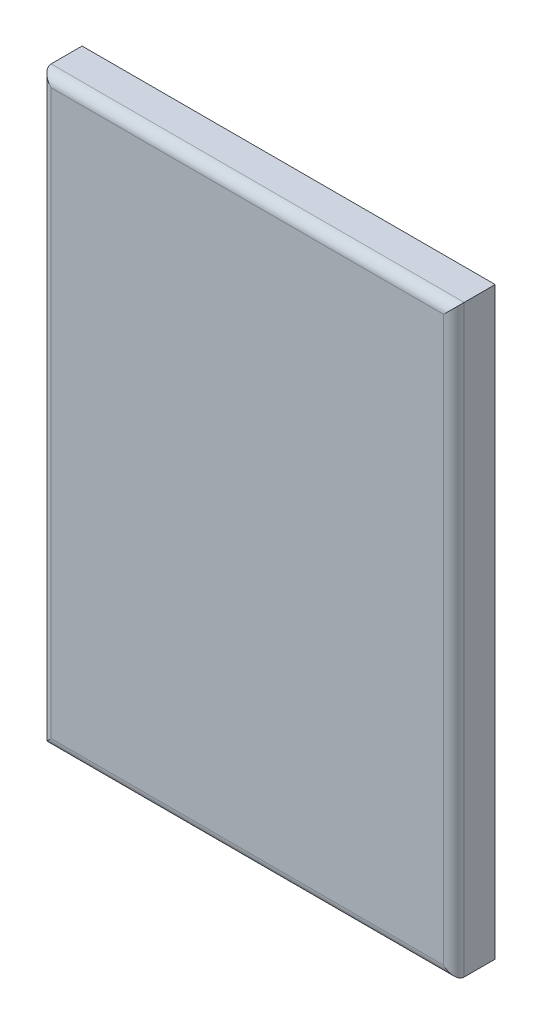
ISO-10303-21;
HEADER;
FILE_DESCRIPTION(('STEP AP214'),'2;1');
FILE_NAME('part.step','',(''),(''),'','','');
FILE_SCHEMA(('AUTOMOTIVE_DESIGN { 1 0 10303 214 1 1 1 1 }'));
ENDSEC;
DATA;
#1=APPLICATION_CONTEXT('core data for automotive mechanical design processes');
#2=APPLICATION_PROTOCOL_DEFINITION('international standard','automotive_design',2000,#1);
#3=PRODUCT_CONTEXT('',#1,'mechanical');
#4=PRODUCT('Part','Part','',(#3));
#5=PRODUCT_RELATED_PRODUCT_CATEGORY('part','',(#4));
#6=PRODUCT_DEFINITION_FORMATION('','',#4);
#7=PRODUCT_DEFINITION_CONTEXT('part definition',#1,'design');
#8=PRODUCT_DEFINITION('design','',#6,#7);
#9=PRODUCT_DEFINITION_SHAPE('','',#8);
#10=(LENGTH_UNIT() NAMED_UNIT(*) SI_UNIT(.MILLI.,.METRE.));
#11=(NAMED_UNIT(*) PLANE_ANGLE_UNIT() SI_UNIT($,.RADIAN.));
#12=(NAMED_UNIT(*) SI_UNIT($,.STERADIAN.) SOLID_ANGLE_UNIT());
#13=UNCERTAINTY_MEASURE_WITH_UNIT(LENGTH_MEASURE(1.E-05),#10,'distance_accuracy_value','');
#14=(GEOMETRIC_REPRESENTATION_CONTEXT(3) GLOBAL_UNCERTAINTY_ASSIGNED_CONTEXT((#13)) GLOBAL_UNIT_ASSIGNED_CONTEXT((#10,
#11,#12)) REPRESENTATION_CONTEXT('',''));
#15=CARTESIAN_POINT('',(0.,0.,0.));
#16=DIRECTION('',(0.,0.,1.));
#17=DIRECTION('',(1.,0.,0.));
#18=AXIS2_PLACEMENT_3D('',#15,#16,#17);
#19=CARTESIAN_POINT('',(40.,0.,4.));
#20=DIRECTION('',(-1.,0.,0.));
#21=DIRECTION('',(0.,0.,1.));
#22=AXIS2_PLACEMENT_3D('',#19,#20,#21);
#23=PLANE('',#22);
#24=DIRECTION('',(0.,0.,-1.));
#25=VECTOR('',#24,1.);
#26=CARTESIAN_POINT('',(40.,56.57,4.));
#27=LINE('',#26,#25);
#28=CARTESIAN_POINT('',(40.,56.57,3.));
#29=VERTEX_POINT('',#28);
#30=CARTESIAN_POINT('',(40.,56.57,0.));
#31=VERTEX_POINT('',#30);
#32=EDGE_CURVE('E82',#29,#31,#27,.T.);
#33=ORIENTED_EDGE('',*,*,#32,.F.);
#34=DIRECTION('',(0.,1.,0.));
#35=VECTOR('',#34,1.);
#36=CARTESIAN_POINT('',(40.,0.,3.));
#37=LINE('',#36,#35);
#38=CARTESIAN_POINT('',(40.,0.,3.));
#39=VERTEX_POINT('',#38);
#40=EDGE_CURVE('E11',#29,#39,#37,.F.);
#41=ORIENTED_EDGE('',*,*,#40,.T.);
#42=DIRECTION('',(0.,0.,-1.));
#43=VECTOR('',#42,1.);
#44=CARTESIAN_POINT('',(40.,0.,4.));
#45=LINE('',#44,#43);
#46=CARTESIAN_POINT('',(40.,0.,0.));
#47=VERTEX_POINT('',#46);
#48=EDGE_CURVE('E102',#39,#47,#45,.T.);
#49=ORIENTED_EDGE('',*,*,#48,.T.);
#50=DIRECTION('',(0.,1.,0.));
#51=VECTOR('',#50,1.);
#52=CARTESIAN_POINT('',(40.,0.,0.));
#53=LINE('',#52,#51);
#54=EDGE_CURVE('E97',#47,#31,#53,.T.);
#55=ORIENTED_EDGE('',*,*,#54,.T.);
#56=EDGE_LOOP('',(#33,#41,#49,#55));
#57=FACE_BOUND('',#56,.T.);
#58=ADVANCED_FACE('F30',(#57),#23,.F.);
#59=CARTESIAN_POINT('',(40.,56.57,4.));
#60=DIRECTION('',(0.,-1.,0.));
#61=DIRECTION('',(0.,0.,-1.));
#62=AXIS2_PLACEMENT_3D('',#59,#60,#61);
#63=PLANE('',#62);
#64=DIRECTION('',(0.,0.,-1.));
#65=VECTOR('',#64,1.);
#66=CARTESIAN_POINT('',(0.,56.57,4.));
#67=LINE('',#66,#65);
#68=CARTESIAN_POINT('',(0.,56.57,3.));
#69=VERTEX_POINT('',#68);
#70=CARTESIAN_POINT('',(0.,56.57,0.));
#71=VERTEX_POINT('',#70);
#72=EDGE_CURVE('E91',#69,#71,#67,.T.);
#73=ORIENTED_EDGE('',*,*,#72,.F.);
#74=DIRECTION('',(-1.,0.,0.));
#75=VECTOR('',#74,1.);
#76=CARTESIAN_POINT('',(40.,56.57,3.));
#77=LINE('',#76,#75);
#78=EDGE_CURVE('E39',#69,#29,#77,.F.);
#79=ORIENTED_EDGE('',*,*,#78,.T.);
#80=ORIENTED_EDGE('',*,*,#32,.T.);
#81=DIRECTION('',(-1.,0.,0.));
#82=VECTOR('',#81,1.);
#83=CARTESIAN_POINT('',(40.,56.57,0.));
#84=LINE('',#83,#82);
#85=EDGE_CURVE('E85',#31,#71,#84,.T.);
#86=ORIENTED_EDGE('',*,*,#85,.T.);
#87=EDGE_LOOP('',(#73,#79,#80,#86));
#88=FACE_BOUND('',#87,.T.);
#89=ADVANCED_FACE('F84',(#88),#63,.F.);
#90=CARTESIAN_POINT('',(0.,0.,4.));
#91=DIRECTION('',(1.,0.,0.));
#92=DIRECTION('',(0.,1.,0.));
#93=AXIS2_PLACEMENT_3D('',#90,#91,#92);
#94=PLANE('',#93);
#95=DIRECTION('',(0.,0.,-1.));
#96=VECTOR('',#95,1.);
#97=CARTESIAN_POINT('',(0.,0.,4.));
#98=LINE('',#97,#96);
#99=CARTESIAN_POINT('',(0.,0.,3.));
#100=VERTEX_POINT('',#99);
#101=CARTESIAN_POINT('',(0.,0.,0.));
#102=VERTEX_POINT('',#101);
#103=EDGE_CURVE('E112',#100,#102,#98,.T.);
#104=ORIENTED_EDGE('',*,*,#103,.F.);
#105=DIRECTION('',(0.,-1.,0.));
#106=VECTOR('',#105,1.);
#107=CARTESIAN_POINT('',(0.,56.57,3.));
#108=LINE('',#107,#106);
#109=EDGE_CURVE('E54',#100,#69,#108,.F.);
#110=ORIENTED_EDGE('',*,*,#109,.T.);
#111=ORIENTED_EDGE('',*,*,#72,.T.);
#112=DIRECTION('',(0.,-1.,0.));
#113=VECTOR('',#112,1.);
#114=CARTESIAN_POINT('',(0.,0.,0.));
#115=LINE('',#114,#113);
#116=EDGE_CURVE('E99',#71,#102,#115,.T.);
#117=ORIENTED_EDGE('',*,*,#116,.T.);
#118=EDGE_LOOP('',(#104,#110,#111,#117));
#119=FACE_BOUND('',#118,.T.);
#120=ADVANCED_FACE('F150',(#119),#94,.F.);
#121=CARTESIAN_POINT('',(40.,0.,4.));
#122=DIRECTION('',(0.,1.,0.));
#123=DIRECTION('',(0.,0.,1.));
#124=AXIS2_PLACEMENT_3D('',#121,#122,#123);
#125=PLANE('',#124);
#126=ORIENTED_EDGE('',*,*,#48,.F.);
#127=DIRECTION('',(1.,0.,0.));
#128=VECTOR('',#127,1.);
#129=CARTESIAN_POINT('',(0.,0.,3.));
#130=LINE('',#129,#128);
#131=EDGE_CURVE('E123',#39,#100,#130,.F.);
#132=ORIENTED_EDGE('',*,*,#131,.T.);
#133=ORIENTED_EDGE('',*,*,#103,.T.);
#134=DIRECTION('',(1.,0.,0.));
#135=VECTOR('',#134,1.);
#136=CARTESIAN_POINT('',(40.,0.,0.));
#137=LINE('',#136,#135);
#138=EDGE_CURVE('E109',#102,#47,#137,.T.);
#139=ORIENTED_EDGE('',*,*,#138,.T.);
#140=EDGE_LOOP('',(#126,#132,#133,#139));
#141=FACE_BOUND('',#140,.T.);
#142=ADVANCED_FACE('F149',(#141),#125,.F.);
#143=CARTESIAN_POINT('',(40.,56.57,4.));
#144=DIRECTION('',(0.,0.,1.));
#145=DIRECTION('',(1.,0.,0.));
#146=AXIS2_PLACEMENT_3D('',#143,#144,#145);
#147=PLANE('',#146);
#148=DIRECTION('',(0.,-1.,0.));
#149=VECTOR('',#148,1.);
#150=CARTESIAN_POINT('',(1.,0.,4.));
#151=LINE('',#150,#149);
#152=CARTESIAN_POINT('',(1.00000000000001,55.57,4.));
#153=VERTEX_POINT('',#152);
#154=CARTESIAN_POINT('',(1.,1.,4.));
#155=VERTEX_POINT('',#154);
#156=EDGE_CURVE('E118',#153,#155,#151,.T.);
#157=ORIENTED_EDGE('',*,*,#156,.T.);
#158=DIRECTION('',(1.,0.,0.));
#159=VECTOR('',#158,1.);
#160=CARTESIAN_POINT('',(40.,1.,4.));
#161=LINE('',#160,#159);
#162=CARTESIAN_POINT('',(39.,1.,4.));
#163=VERTEX_POINT('',#162);
#164=EDGE_CURVE('E120',#155,#163,#161,.T.);
#165=ORIENTED_EDGE('',*,*,#164,.T.);
#166=DIRECTION('',(0.,1.,0.));
#167=VECTOR('',#166,1.);
#168=CARTESIAN_POINT('',(39.,56.57,4.));
#169=LINE('',#168,#167);
#170=CARTESIAN_POINT('',(39.,55.57,4.));
#171=VERTEX_POINT('',#170);
#172=EDGE_CURVE('E90',#163,#171,#169,.T.);
#173=ORIENTED_EDGE('',*,*,#172,.T.);
#174=DIRECTION('',(-1.,0.,0.));
#175=VECTOR('',#174,1.);
#176=CARTESIAN_POINT('',(0.,55.57,4.));
#177=LINE('',#176,#175);
#178=EDGE_CURVE('E116',#171,#153,#177,.T.);
#179=ORIENTED_EDGE('',*,*,#178,.T.);
#180=EDGE_LOOP('',(#157,#165,#173,#179));
#181=FACE_BOUND('',#180,.T.);
#182=ADVANCED_FACE('F142',(#181),#147,.T.);
#183=CARTESIAN_POINT('',(40.,56.57,0.));
#184=DIRECTION('',(0.,0.,1.));
#185=DIRECTION('',(1.,0.,0.));
#186=AXIS2_PLACEMENT_3D('',#183,#184,#185);
#187=PLANE('',#186);
#188=ORIENTED_EDGE('',*,*,#54,.F.);
#189=ORIENTED_EDGE('',*,*,#138,.F.);
#190=ORIENTED_EDGE('',*,*,#116,.F.);
#191=ORIENTED_EDGE('',*,*,#85,.F.);
#192=EDGE_LOOP('',(#188,#189,#190,#191));
#193=FACE_BOUND('',#192,.T.);
#194=ADVANCED_FACE('F95',(#193),#187,.F.);
#195=CARTESIAN_POINT('',(40.,55.57,3.));
#196=DIRECTION('',(1.,0.,0.));
#197=DIRECTION('',(0.,0.,-1.));
#198=AXIS2_PLACEMENT_3D('',#195,#196,#197);
#199=CYLINDRICAL_SURFACE('',#198,1.);
#200=CARTESIAN_POINT('',(39.,55.57,3.));
#201=DIRECTION('',(0.707106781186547,-0.707106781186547,0.));
#202=DIRECTION('',(-0.707106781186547,-0.707106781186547,0.));
#203=AXIS2_PLACEMENT_3D('',#200,#201,#202);
#204=ELLIPSE('',#203,1.41421356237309,1.);
#205=EDGE_CURVE('E106',#29,#171,#204,.T.);
#206=ORIENTED_EDGE('',*,*,#205,.F.);
#207=ORIENTED_EDGE('',*,*,#78,.F.);
#208=CARTESIAN_POINT('',(1.00000000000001,55.57,3.));
#209=DIRECTION('',(0.707106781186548,0.707106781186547,0.));
#210=DIRECTION('',(0.707106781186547,-0.707106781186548,0.));
#211=AXIS2_PLACEMENT_3D('',#208,#209,#210);
#212=ELLIPSE('',#211,1.41421356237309,1.);
#213=EDGE_CURVE('E34',#153,#69,#212,.F.);
#214=ORIENTED_EDGE('',*,*,#213,.F.);
#215=ORIENTED_EDGE('',*,*,#178,.F.);
#216=EDGE_LOOP('',(#206,#207,#214,#215));
#217=FACE_BOUND('',#216,.T.);
#218=ADVANCED_FACE('F32',(#217),#199,.T.);
#219=CARTESIAN_POINT('',(1.00000000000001,56.57,3.));
#220=DIRECTION('',(0.,1.,0.));
#221=DIRECTION('',(-1.,0.,0.));
#222=AXIS2_PLACEMENT_3D('',#219,#220,#221);
#223=CYLINDRICAL_SURFACE('',#222,1.);
#224=ORIENTED_EDGE('',*,*,#213,.T.);
#225=ORIENTED_EDGE('',*,*,#109,.F.);
#226=CARTESIAN_POINT('',(1.,1.,3.));
#227=DIRECTION('',(-0.707106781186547,0.707106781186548,0.));
#228=DIRECTION('',(0.707106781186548,0.707106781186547,0.));
#229=AXIS2_PLACEMENT_3D('',#226,#227,#228);
#230=ELLIPSE('',#229,1.4142135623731,1.);
#231=EDGE_CURVE('E130',#155,#100,#230,.F.);
#232=ORIENTED_EDGE('',*,*,#231,.F.);
#233=ORIENTED_EDGE('',*,*,#156,.F.);
#234=EDGE_LOOP('',(#224,#225,#232,#233));
#235=FACE_BOUND('',#234,.T.);
#236=ADVANCED_FACE('F167',(#235),#223,.T.);
#237=CARTESIAN_POINT('',(39.,56.57,3.));
#238=DIRECTION('',(0.,-1.,0.));
#239=DIRECTION('',(0.,0.,-1.));
#240=AXIS2_PLACEMENT_3D('',#237,#238,#239);
#241=CYLINDRICAL_SURFACE('',#240,1.);
#242=ORIENTED_EDGE('',*,*,#205,.T.);
#243=ORIENTED_EDGE('',*,*,#172,.F.);
#244=CARTESIAN_POINT('',(39.,1.,3.));
#245=DIRECTION('',(-0.707106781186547,-0.707106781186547,0.));
#246=DIRECTION('',(0.707106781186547,-0.707106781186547,0.));
#247=AXIS2_PLACEMENT_3D('',#244,#245,#246);
#248=ELLIPSE('',#247,1.41421356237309,1.);
#249=EDGE_CURVE('E128',#39,#163,#248,.T.);
#250=ORIENTED_EDGE('',*,*,#249,.F.);
#251=ORIENTED_EDGE('',*,*,#40,.F.);
#252=EDGE_LOOP('',(#242,#243,#250,#251));
#253=FACE_BOUND('',#252,.T.);
#254=ADVANCED_FACE('F135',(#253),#241,.T.);
#255=CARTESIAN_POINT('',(40.,1.,3.));
#256=DIRECTION('',(-1.,0.,0.));
#257=DIRECTION('',(0.,0.,1.));
#258=AXIS2_PLACEMENT_3D('',#255,#256,#257);
#259=CYLINDRICAL_SURFACE('',#258,1.);
#260=ORIENTED_EDGE('',*,*,#231,.T.);
#261=ORIENTED_EDGE('',*,*,#131,.F.);
#262=ORIENTED_EDGE('',*,*,#249,.T.);
#263=ORIENTED_EDGE('',*,*,#164,.F.);
#264=EDGE_LOOP('',(#260,#261,#262,#263));
#265=FACE_BOUND('',#264,.T.);
#266=ADVANCED_FACE('F146',(#265),#259,.T.);
#267=CLOSED_SHELL('',(#58,#89,#120,#142,#182,#194,#218,#236,#254,#266));
#268=MANIFOLD_SOLID_BREP('B2',#267);
#269=ADVANCED_BREP_SHAPE_REPRESENTATION('',(#18,#268),#14);
#270=SHAPE_DEFINITION_REPRESENTATION(#9,#269);
ENDSEC;
END-ISO-10303-21;
